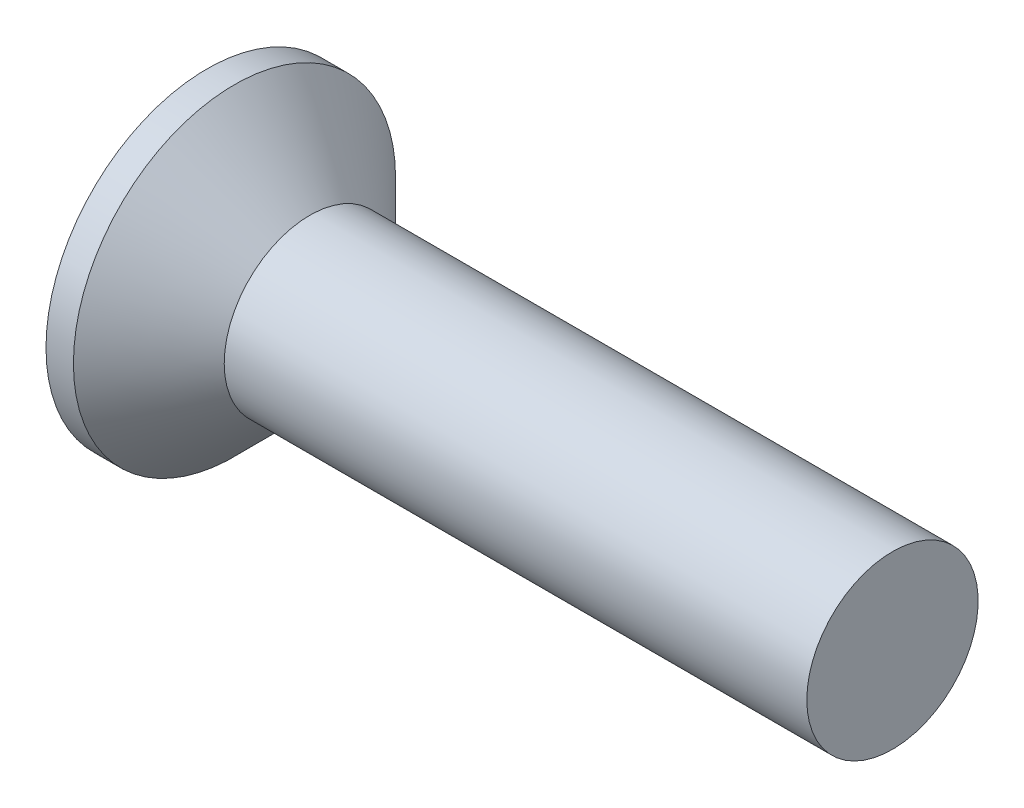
ISO-10303-21;
HEADER;
FILE_DESCRIPTION(('STEP AP214'),'2;1');
FILE_NAME('part.step','',(''),(''),'','','');
FILE_SCHEMA(('AUTOMOTIVE_DESIGN { 1 0 10303 214 1 1 1 1 }'));
ENDSEC;
DATA;
#1=APPLICATION_CONTEXT('core data for automotive mechanical design processes');
#2=APPLICATION_PROTOCOL_DEFINITION('international standard','automotive_design',2000,#1);
#3=PRODUCT_CONTEXT('',#1,'mechanical');
#4=PRODUCT('Part','Part','',(#3));
#5=PRODUCT_RELATED_PRODUCT_CATEGORY('part','',(#4));
#6=PRODUCT_DEFINITION_FORMATION('','',#4);
#7=PRODUCT_DEFINITION_CONTEXT('part definition',#1,'design');
#8=PRODUCT_DEFINITION('design','',#6,#7);
#9=PRODUCT_DEFINITION_SHAPE('','',#8);
#10=(LENGTH_UNIT() NAMED_UNIT(*) SI_UNIT(.MILLI.,.METRE.));
#11=(NAMED_UNIT(*) PLANE_ANGLE_UNIT() SI_UNIT($,.RADIAN.));
#12=(NAMED_UNIT(*) SI_UNIT($,.STERADIAN.) SOLID_ANGLE_UNIT());
#13=UNCERTAINTY_MEASURE_WITH_UNIT(LENGTH_MEASURE(1.E-05),#10,'distance_accuracy_value','');
#14=(GEOMETRIC_REPRESENTATION_CONTEXT(3) GLOBAL_UNCERTAINTY_ASSIGNED_CONTEXT((#13)) GLOBAL_UNIT_ASSIGNED_CONTEXT((#10,
#11,#12)) REPRESENTATION_CONTEXT('',''));
#15=CARTESIAN_POINT('',(0.,0.,0.));
#16=DIRECTION('',(0.,0.,1.));
#17=DIRECTION('',(1.,0.,0.));
#18=AXIS2_PLACEMENT_3D('',#15,#16,#17);
#19=CARTESIAN_POINT('',(0.,0.,0.));
#20=DIRECTION('',(-1.,0.,0.));
#21=DIRECTION('',(0.,0.,1.));
#22=AXIS2_PLACEMENT_3D('',#19,#20,#21);
#23=PLANE('',#22);
#24=CARTESIAN_POINT('',(0.,0.,0.));
#25=DIRECTION('',(-1.,0.,0.));
#26=DIRECTION('',(0.,0.,1.));
#27=AXIS2_PLACEMENT_3D('',#24,#25,#26);
#28=CIRCLE('',#27,2.35);
#29=CARTESIAN_POINT('',(0.,0.,2.35));
#30=VERTEX_POINT('',#29);
#31=EDGE_CURVE('E37',#30,#30,#28,.T.);
#32=ORIENTED_EDGE('',*,*,#31,.T.);
#33=EDGE_LOOP('',(#32));
#34=FACE_BOUND('',#33,.T.);
#35=DIRECTION('',(0.,1.,0.));
#36=VECTOR('',#35,1.);
#37=CARTESIAN_POINT('',(0.,-1.4,-0.37));
#38=LINE('',#37,#36);
#39=CARTESIAN_POINT('',(0.,-1.4,-0.37));
#40=VERTEX_POINT('',#39);
#41=CARTESIAN_POINT('',(0.,-0.369999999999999,-0.37));
#42=VERTEX_POINT('',#41);
#43=EDGE_CURVE('E98',#40,#42,#38,.T.);
#44=ORIENTED_EDGE('',*,*,#43,.T.);
#45=DIRECTION('',(0.,0.,-1.));
#46=VECTOR('',#45,1.);
#47=CARTESIAN_POINT('',(0.,-0.370000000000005,1.4));
#48=LINE('',#47,#46);
#49=CARTESIAN_POINT('',(0.,-0.369999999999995,-1.4));
#50=VERTEX_POINT('',#49);
#51=EDGE_CURVE('E78',#42,#50,#48,.T.);
#52=ORIENTED_EDGE('',*,*,#51,.T.);
#53=DIRECTION('',(0.,1.,0.));
#54=VECTOR('',#53,1.);
#55=CARTESIAN_POINT('',(0.,-0.369999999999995,-1.4));
#56=LINE('',#55,#54);
#57=CARTESIAN_POINT('',(0.,0.370000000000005,-1.4));
#58=VERTEX_POINT('',#57);
#59=EDGE_CURVE('E333',#50,#58,#56,.T.);
#60=ORIENTED_EDGE('',*,*,#59,.T.);
#61=DIRECTION('',(0.,0.,1.));
#62=VECTOR('',#61,1.);
#63=CARTESIAN_POINT('',(0.,0.370000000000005,-1.4));
#64=LINE('',#63,#62);
#65=CARTESIAN_POINT('',(0.,0.370000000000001,-0.37));
#66=VERTEX_POINT('',#65);
#67=EDGE_CURVE('E94',#58,#66,#64,.T.);
#68=ORIENTED_EDGE('',*,*,#67,.T.);
#69=CARTESIAN_POINT('',(0.,1.4,-0.37));
#70=VERTEX_POINT('',#69);
#71=EDGE_CURVE('E88',#66,#70,#38,.T.);
#72=ORIENTED_EDGE('',*,*,#71,.T.);
#73=DIRECTION('',(0.,0.,1.));
#74=VECTOR('',#73,1.);
#75=CARTESIAN_POINT('',(0.,1.4,-0.37));
#76=LINE('',#75,#74);
#77=CARTESIAN_POINT('',(0.,1.4,0.37));
#78=VERTEX_POINT('',#77);
#79=EDGE_CURVE('E91',#70,#78,#76,.T.);
#80=ORIENTED_EDGE('',*,*,#79,.T.);
#81=DIRECTION('',(0.,-1.,0.));
#82=VECTOR('',#81,1.);
#83=CARTESIAN_POINT('',(0.,1.4,0.37));
#84=LINE('',#83,#82);
#85=CARTESIAN_POINT('',(0.,0.369999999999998,0.37));
#86=VERTEX_POINT('',#85);
#87=EDGE_CURVE('E345',#78,#86,#84,.T.);
#88=ORIENTED_EDGE('',*,*,#87,.T.);
#89=CARTESIAN_POINT('',(0.,0.369999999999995,1.4));
#90=VERTEX_POINT('',#89);
#91=EDGE_CURVE('E328',#86,#90,#64,.T.);
#92=ORIENTED_EDGE('',*,*,#91,.T.);
#93=DIRECTION('',(0.,-1.,0.));
#94=VECTOR('',#93,1.);
#95=CARTESIAN_POINT('',(0.,0.369999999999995,1.4));
#96=LINE('',#95,#94);
#97=CARTESIAN_POINT('',(0.,-0.370000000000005,1.4));
#98=VERTEX_POINT('',#97);
#99=EDGE_CURVE('E314',#90,#98,#96,.T.);
#100=ORIENTED_EDGE('',*,*,#99,.T.);
#101=CARTESIAN_POINT('',(0.,-0.370000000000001,0.37));
#102=VERTEX_POINT('',#101);
#103=EDGE_CURVE('E326',#98,#102,#48,.T.);
#104=ORIENTED_EDGE('',*,*,#103,.T.);
#105=CARTESIAN_POINT('',(0.,-1.4,0.37));
#106=VERTEX_POINT('',#105);
#107=EDGE_CURVE('E104',#102,#106,#84,.T.);
#108=ORIENTED_EDGE('',*,*,#107,.T.);
#109=DIRECTION('',(0.,0.,-1.));
#110=VECTOR('',#109,1.);
#111=CARTESIAN_POINT('',(0.,-1.4,0.37));
#112=LINE('',#111,#110);
#113=EDGE_CURVE('E127',#106,#40,#112,.T.);
#114=ORIENTED_EDGE('',*,*,#113,.T.);
#115=EDGE_LOOP('',(#44,#52,#60,#68,#72,#80,#88,#92,#100,#104,#108,#114));
#116=FACE_BOUND('',#115,.T.);
#117=ADVANCED_FACE('F30',(#34,#116),#23,.T.);
#118=CARTESIAN_POINT('',(2.05102880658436,0.,0.156831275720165));
#119=DIRECTION('',(-0.103375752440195,0.,-0.99464237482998));
#120=DIRECTION('',(-0.994642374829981,0.,0.103375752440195));
#121=AXIS2_PLACEMENT_3D('',#118,#119,#120);
#122=PLANE('',#121);
#123=ORIENTED_EDGE('',*,*,#107,.F.);
#124=DIRECTION('',(0.989369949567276,0.102827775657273,-0.102827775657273));
#125=VECTOR('',#124,1.);
#126=CARTESIAN_POINT('',(2.06698399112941,-0.155173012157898,0.155173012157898));
#127=LINE('',#126,#125);
#128=CARTESIAN_POINT('',(1.78,-0.185000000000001,0.184999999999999));
#129=VERTEX_POINT('',#128);
#130=EDGE_CURVE('E122',#102,#129,#127,.T.);
#131=ORIENTED_EDGE('',*,*,#130,.T.);
#132=DIRECTION('',(0.822906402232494,0.561702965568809,-0.0855267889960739));
#133=VECTOR('',#132,1.);
#134=CARTESIAN_POINT('',(0.,-1.4,0.37));
#135=LINE('',#134,#133);
#136=EDGE_CURVE('E99',#106,#129,#135,.T.);
#137=ORIENTED_EDGE('',*,*,#136,.F.);
#138=EDGE_LOOP('',(#123,#131,#137));
#139=FACE_BOUND('',#138,.T.);
#140=ADVANCED_FACE('F150',(#139),#122,.T.);
#141=DIRECTION('',(0.822906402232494,-0.561702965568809,-0.0855267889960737));
#142=VECTOR('',#141,1.);
#143=CARTESIAN_POINT('',(0.,1.4,0.37));
#144=LINE('',#143,#142);
#145=CARTESIAN_POINT('',(1.78,0.185,0.185));
#146=VERTEX_POINT('',#145);
#147=EDGE_CURVE('E44',#78,#146,#144,.T.);
#148=ORIENTED_EDGE('',*,*,#147,.T.);
#149=DIRECTION('',(-0.989369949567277,0.102827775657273,0.102827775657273));
#150=VECTOR('',#149,1.);
#151=CARTESIAN_POINT('',(2.06698399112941,0.155173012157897,0.155173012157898));
#152=LINE('',#151,#150);
#153=EDGE_CURVE('E341',#146,#86,#152,.T.);
#154=ORIENTED_EDGE('',*,*,#153,.T.);
#155=ORIENTED_EDGE('',*,*,#87,.F.);
#156=EDGE_LOOP('',(#148,#154,#155));
#157=FACE_BOUND('',#156,.T.);
#158=ADVANCED_FACE('F154',(#157),#122,.T.);
#159=CARTESIAN_POINT('',(2.05102880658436,0.,-0.156831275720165));
#160=DIRECTION('',(-0.103375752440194,0.,0.994642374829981));
#161=DIRECTION('',(0.994642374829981,0.,0.103375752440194));
#162=AXIS2_PLACEMENT_3D('',#159,#160,#161);
#163=PLANE('',#162);
#164=DIRECTION('',(0.822906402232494,0.561702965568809,0.0855267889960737));
#165=VECTOR('',#164,1.);
#166=CARTESIAN_POINT('',(0.,-1.4,-0.37));
#167=LINE('',#166,#165);
#168=CARTESIAN_POINT('',(1.78,-0.184999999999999,-0.185000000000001));
#169=VERTEX_POINT('',#168);
#170=EDGE_CURVE('E53',#40,#169,#167,.T.);
#171=ORIENTED_EDGE('',*,*,#170,.T.);
#172=DIRECTION('',(-0.989369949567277,-0.102827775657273,-0.102827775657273));
#173=VECTOR('',#172,1.);
#174=CARTESIAN_POINT('',(2.06698399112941,-0.155173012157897,-0.155173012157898));
#175=LINE('',#174,#173);
#176=EDGE_CURVE('E11',#169,#42,#175,.T.);
#177=ORIENTED_EDGE('',*,*,#176,.T.);
#178=ORIENTED_EDGE('',*,*,#43,.F.);
#179=EDGE_LOOP('',(#171,#177,#178));
#180=FACE_BOUND('',#179,.T.);
#181=ADVANCED_FACE('F147',(#180),#163,.T.);
#182=ORIENTED_EDGE('',*,*,#71,.F.);
#183=DIRECTION('',(0.989369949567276,-0.102827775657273,0.102827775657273));
#184=VECTOR('',#183,1.);
#185=CARTESIAN_POINT('',(2.06698399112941,0.155173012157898,-0.155173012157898));
#186=LINE('',#185,#184);
#187=CARTESIAN_POINT('',(1.78,0.185,-0.185));
#188=VERTEX_POINT('',#187);
#189=EDGE_CURVE('E107',#66,#188,#186,.T.);
#190=ORIENTED_EDGE('',*,*,#189,.T.);
#191=DIRECTION('',(0.822906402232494,-0.561702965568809,0.0855267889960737));
#192=VECTOR('',#191,1.);
#193=CARTESIAN_POINT('',(0.,1.4,-0.37));
#194=LINE('',#193,#192);
#195=EDGE_CURVE('E103',#70,#188,#194,.T.);
#196=ORIENTED_EDGE('',*,*,#195,.F.);
#197=EDGE_LOOP('',(#182,#190,#196));
#198=FACE_BOUND('',#197,.T.);
#199=ADVANCED_FACE('F106',(#198),#163,.T.);
#200=CARTESIAN_POINT('',(-6.34999999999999,0.,0.));
#201=DIRECTION('',(-1.,0.,0.));
#202=DIRECTION('',(0.,0.,1.));
#203=AXIS2_PLACEMENT_3D('',#200,#201,#202);
#204=CYLINDRICAL_SURFACE('',#203,2.35);
#205=CARTESIAN_POINT('',(0.400000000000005,0.,0.));
#206=DIRECTION('',(-1.,0.,0.));
#207=DIRECTION('',(0.,0.,1.));
#208=AXIS2_PLACEMENT_3D('',#205,#206,#207);
#209=CIRCLE('',#208,2.35);
#210=CARTESIAN_POINT('',(0.400000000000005,0.,2.35));
#211=VERTEX_POINT('',#210);
#212=EDGE_CURVE('E130',#211,#211,#209,.T.);
#213=ORIENTED_EDGE('',*,*,#212,.T.);
#214=EDGE_LOOP('',(#213));
#215=FACE_BOUND('',#214,.T.);
#216=ORIENTED_EDGE('',*,*,#31,.F.);
#217=EDGE_LOOP('',(#216));
#218=FACE_BOUND('',#217,.T.);
#219=ADVANCED_FACE('F136',(#215,#218),#204,.T.);
#220=CARTESIAN_POINT('',(0.400000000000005,0.,0.));
#221=DIRECTION('',(-1.,0.,0.));
#222=DIRECTION('',(0.,0.,1.));
#223=AXIS2_PLACEMENT_3D('',#220,#221,#222);
#224=CONICAL_SURFACE('',#223,2.35,0.78539816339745);
#225=CARTESIAN_POINT('',(1.5,0.,0.));
#226=DIRECTION('',(-1.,0.,0.));
#227=DIRECTION('',(0.,0.,1.));
#228=AXIS2_PLACEMENT_3D('',#225,#226,#227);
#229=CIRCLE('',#228,1.25);
#230=CARTESIAN_POINT('',(1.5,0.,1.25));
#231=VERTEX_POINT('',#230);
#232=EDGE_CURVE('E126',#231,#231,#229,.T.);
#233=ORIENTED_EDGE('',*,*,#232,.T.);
#234=EDGE_LOOP('',(#233));
#235=FACE_BOUND('',#234,.T.);
#236=ORIENTED_EDGE('',*,*,#212,.F.);
#237=EDGE_LOOP('',(#236));
#238=FACE_BOUND('',#237,.T.);
#239=ADVANCED_FACE('F138',(#235,#238),#224,.T.);
#240=CARTESIAN_POINT('',(-6.34999999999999,0.,0.));
#241=DIRECTION('',(-1.,0.,0.));
#242=DIRECTION('',(0.,0.,1.));
#243=AXIS2_PLACEMENT_3D('',#240,#241,#242);
#244=CYLINDRICAL_SURFACE('',#243,1.25);
#245=CARTESIAN_POINT('',(10.,0.,0.));
#246=DIRECTION('',(-1.,0.,0.));
#247=DIRECTION('',(0.,0.,1.));
#248=AXIS2_PLACEMENT_3D('',#245,#246,#247);
#249=CIRCLE('',#248,1.25);
#250=CARTESIAN_POINT('',(10.,0.,1.25));
#251=VERTEX_POINT('',#250);
#252=EDGE_CURVE('E123',#251,#251,#249,.T.);
#253=ORIENTED_EDGE('',*,*,#252,.T.);
#254=EDGE_LOOP('',(#253));
#255=FACE_BOUND('',#254,.T.);
#256=ORIENTED_EDGE('',*,*,#232,.F.);
#257=EDGE_LOOP('',(#256));
#258=FACE_BOUND('',#257,.T.);
#259=ADVANCED_FACE('F144',(#255,#258),#244,.T.);
#260=CARTESIAN_POINT('',(10.,1.25,0.));
#261=DIRECTION('',(1.,0.,0.));
#262=DIRECTION('',(0.,0.,-1.));
#263=AXIS2_PLACEMENT_3D('',#260,#261,#262);
#264=PLANE('',#263);
#265=ORIENTED_EDGE('',*,*,#252,.F.);
#266=EDGE_LOOP('',(#265));
#267=FACE_BOUND('',#266,.T.);
#268=ADVANCED_FACE('F174',(#267),#264,.T.);
#269=CARTESIAN_POINT('',(1.78,0.185,-0.185));
#270=DIRECTION('',(1.,0.,0.));
#271=DIRECTION('',(0.,0.,-1.));
#272=AXIS2_PLACEMENT_3D('',#269,#270,#271);
#273=PLANE('',#272);
#274=DIRECTION('',(0.,1.,0.));
#275=VECTOR('',#274,1.);
#276=CARTESIAN_POINT('',(1.78,-0.185,-0.185));
#277=LINE('',#276,#275);
#278=EDGE_CURVE('E118',#169,#188,#277,.T.);
#279=ORIENTED_EDGE('',*,*,#278,.F.);
#280=DIRECTION('',(0.,0.,-1.));
#281=VECTOR('',#280,1.);
#282=CARTESIAN_POINT('',(1.78,-0.185,0.185));
#283=LINE('',#282,#281);
#284=EDGE_CURVE('E109',#129,#169,#283,.T.);
#285=ORIENTED_EDGE('',*,*,#284,.F.);
#286=DIRECTION('',(0.,-1.,0.));
#287=VECTOR('',#286,1.);
#288=CARTESIAN_POINT('',(1.78,0.185,0.185));
#289=LINE('',#288,#287);
#290=EDGE_CURVE('E112',#146,#129,#289,.T.);
#291=ORIENTED_EDGE('',*,*,#290,.F.);
#292=DIRECTION('',(0.,0.,1.));
#293=VECTOR('',#292,1.);
#294=CARTESIAN_POINT('',(1.78,0.185,-0.185));
#295=LINE('',#294,#293);
#296=EDGE_CURVE('E116',#188,#146,#295,.T.);
#297=ORIENTED_EDGE('',*,*,#296,.F.);
#298=EDGE_LOOP('',(#279,#285,#291,#297));
#299=FACE_BOUND('',#298,.T.);
#300=ADVANCED_FACE('F171',(#299),#273,.F.);
#301=CARTESIAN_POINT('',(1.78,-0.185,-0.185));
#302=DIRECTION('',(-0.563768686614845,0.825932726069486,0.));
#303=DIRECTION('',(-0.825932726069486,-0.563768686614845,0.));
#304=AXIS2_PLACEMENT_3D('',#301,#302,#303);
#305=PLANE('',#304);
#306=ORIENTED_EDGE('',*,*,#170,.F.);
#307=ORIENTED_EDGE('',*,*,#113,.F.);
#308=ORIENTED_EDGE('',*,*,#136,.T.);
#309=ORIENTED_EDGE('',*,*,#284,.T.);
#310=EDGE_LOOP('',(#306,#307,#308,#309));
#311=FACE_BOUND('',#310,.T.);
#312=ADVANCED_FACE('F163',(#311),#305,.T.);
#313=CARTESIAN_POINT('',(0.,1.4,0.37));
#314=DIRECTION('',(-0.563768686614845,-0.825932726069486,0.));
#315=DIRECTION('',(0.825932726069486,-0.563768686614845,0.));
#316=AXIS2_PLACEMENT_3D('',#313,#314,#315);
#317=PLANE('',#316);
#318=ORIENTED_EDGE('',*,*,#147,.F.);
#319=ORIENTED_EDGE('',*,*,#79,.F.);
#320=ORIENTED_EDGE('',*,*,#195,.T.);
#321=ORIENTED_EDGE('',*,*,#296,.T.);
#322=EDGE_LOOP('',(#318,#319,#320,#321));
#323=FACE_BOUND('',#322,.T.);
#324=ADVANCED_FACE('F102',(#323),#317,.T.);
#325=CARTESIAN_POINT('',(2.05102880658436,-0.156831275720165,0.));
#326=DIRECTION('',(-0.103375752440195,0.99464237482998,0.));
#327=DIRECTION('',(-0.994642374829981,-0.103375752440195,0.));
#328=AXIS2_PLACEMENT_3D('',#325,#326,#327);
#329=PLANE('',#328);
#330=DIRECTION('',(0.822906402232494,0.0855267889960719,0.561702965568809));
#331=VECTOR('',#330,1.);
#332=CARTESIAN_POINT('',(0.,-0.369999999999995,-1.4));
#333=LINE('',#332,#331);
#334=EDGE_CURVE('E335',#50,#169,#333,.T.);
#335=ORIENTED_EDGE('',*,*,#334,.F.);
#336=ORIENTED_EDGE('',*,*,#51,.F.);
#337=ORIENTED_EDGE('',*,*,#176,.F.);
#338=EDGE_LOOP('',(#335,#336,#337));
#339=FACE_BOUND('',#338,.T.);
#340=ADVANCED_FACE('F170',(#339),#329,.T.);
#341=CARTESIAN_POINT('',(2.05102880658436,0.156831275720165,0.));
#342=DIRECTION('',(-0.103375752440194,-0.994642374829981,0.));
#343=DIRECTION('',(0.994642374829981,-0.103375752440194,0.));
#344=AXIS2_PLACEMENT_3D('',#341,#342,#343);
#345=PLANE('',#344);
#346=ORIENTED_EDGE('',*,*,#67,.F.);
#347=DIRECTION('',(0.822906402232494,-0.0855267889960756,0.561702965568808));
#348=VECTOR('',#347,1.);
#349=CARTESIAN_POINT('',(0.,0.370000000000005,-1.4));
#350=LINE('',#349,#348);
#351=EDGE_CURVE('E69',#58,#188,#350,.T.);
#352=ORIENTED_EDGE('',*,*,#351,.T.);
#353=ORIENTED_EDGE('',*,*,#189,.F.);
#354=EDGE_LOOP('',(#346,#352,#353));
#355=FACE_BOUND('',#354,.T.);
#356=ADVANCED_FACE('F214',(#355),#345,.T.);
#357=CARTESIAN_POINT('',(1.78,0.185000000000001,-0.184999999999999));
#358=DIRECTION('',(-0.563768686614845,0.,0.825932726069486));
#359=DIRECTION('',(-0.825932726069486,0.,-0.563768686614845));
#360=AXIS2_PLACEMENT_3D('',#357,#358,#359);
#361=PLANE('',#360);
#362=ORIENTED_EDGE('',*,*,#351,.F.);
#363=ORIENTED_EDGE('',*,*,#59,.F.);
#364=ORIENTED_EDGE('',*,*,#334,.T.);
#365=ORIENTED_EDGE('',*,*,#278,.T.);
#366=EDGE_LOOP('',(#362,#363,#364,#365));
#367=FACE_BOUND('',#366,.T.);
#368=ADVANCED_FACE('F222',(#367),#361,.T.);
#369=ORIENTED_EDGE('',*,*,#103,.F.);
#370=DIRECTION('',(0.822906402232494,0.0855267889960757,-0.561702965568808));
#371=VECTOR('',#370,1.);
#372=CARTESIAN_POINT('',(0.,-0.370000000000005,1.4));
#373=LINE('',#372,#371);
#374=EDGE_CURVE('E311',#98,#129,#373,.T.);
#375=ORIENTED_EDGE('',*,*,#374,.T.);
#376=ORIENTED_EDGE('',*,*,#130,.F.);
#377=EDGE_LOOP('',(#369,#375,#376));
#378=FACE_BOUND('',#377,.T.);
#379=ADVANCED_FACE('F216',(#378),#329,.T.);
#380=DIRECTION('',(0.822906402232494,-0.0855267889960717,-0.561702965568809));
#381=VECTOR('',#380,1.);
#382=CARTESIAN_POINT('',(0.,0.369999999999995,1.4));
#383=LINE('',#382,#381);
#384=EDGE_CURVE('E322',#90,#146,#383,.T.);
#385=ORIENTED_EDGE('',*,*,#384,.F.);
#386=ORIENTED_EDGE('',*,*,#91,.F.);
#387=ORIENTED_EDGE('',*,*,#153,.F.);
#388=EDGE_LOOP('',(#385,#386,#387));
#389=FACE_BOUND('',#388,.T.);
#390=ADVANCED_FACE('F224',(#389),#345,.T.);
#391=CARTESIAN_POINT('',(0.,-0.370000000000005,1.4));
#392=DIRECTION('',(-0.563768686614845,0.,-0.825932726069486));
#393=DIRECTION('',(0.825932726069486,0.,-0.563768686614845));
#394=AXIS2_PLACEMENT_3D('',#391,#392,#393);
#395=PLANE('',#394);
#396=ORIENTED_EDGE('',*,*,#374,.F.);
#397=ORIENTED_EDGE('',*,*,#99,.F.);
#398=ORIENTED_EDGE('',*,*,#384,.T.);
#399=ORIENTED_EDGE('',*,*,#290,.T.);
#400=EDGE_LOOP('',(#396,#397,#398,#399));
#401=FACE_BOUND('',#400,.T.);
#402=ADVANCED_FACE('F243',(#401),#395,.T.);
#403=CLOSED_SHELL('',(#117,#140,#158,#181,#199,#219,#239,#259,#268,#300,#312,#324,#340,#356,
#368,#379,#390,#402));
#404=MANIFOLD_SOLID_BREP('B2',#403);
#405=ADVANCED_BREP_SHAPE_REPRESENTATION('',(#18,#404),#14);
#406=SHAPE_DEFINITION_REPRESENTATION(#9,#405);
ENDSEC;
END-ISO-10303-21;
